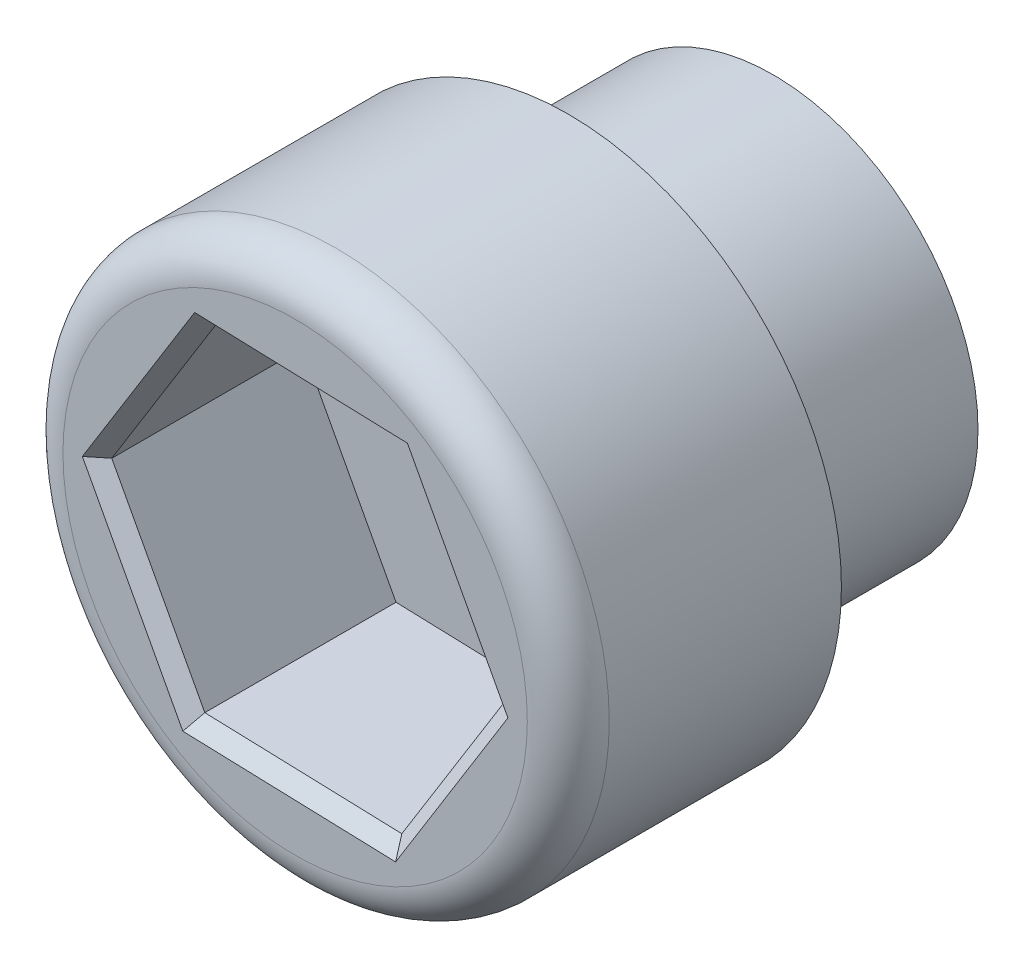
from build123d import *

# Parameters (mm, degrees)
SZKIC1_R                    = 3
DODANIE_WYCI_GNI_CIE1_DEPTH = 3
SZKIC2_R                    = 4
DODANIE_WYCI_GNI_CIE2_DEPTH = 4
WYTNIJ_WYCI_GNI_CIE1_DEPTH  = 3
ZAOKR_GLENIE1_R             = 0.6
SFAZOWANIE1_SIZE            = 0.2


with BuildPart() as part:
    # Szkic1 → Dodanie-wyci_gni_cie1 (new body)
    with BuildSketch(Plane.XY):
        Circle(SZKIC1_R)
    extrude(amount=DODANIE_WYCI_GNI_CIE1_DEPTH)

    # Szkic2 → Dodanie-wyci_gni_cie2 (add)
    with BuildSketch(Plane.XY.offset(3)):
        Circle(SZKIC2_R)
    extrude(amount=DODANIE_WYCI_GNI_CIE2_DEPTH)

    # Szkic3 → Wytnij-wyci_gni_cie1 (cut)
    with BuildSketch(Plane.XY.offset(7)):
        Polygon((-1.362395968, 2.545036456), (-2.885264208, 0.09264871), (-1.52286824, -2.452387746), (1.362395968, -2.545036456), (2.885264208, -0.09264871), (1.52286824, 2.452387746), align=None)
    extrude(amount=-WYTNIJ_WYCI_GNI_CIE1_DEPTH, mode=Mode.SUBTRACT)

    # Zaokr_glenie1
    zaokr_glenie1_edges = [part.edges().sort_by_distance(p)[0] for p in [
        (-4, 0, 7),
    ]]
    fillet(zaokr_glenie1_edges, radius=ZAOKR_GLENIE1_R)

    # Sfazowanie1
    sfazowanie1_edges = [part.edges().sort_by_distance(p)[0] for p in [
        (0.080236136, 2.498712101, 7),
        (-2.123830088, 1.318842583, 7),
        (-2.204066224, -1.179869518, 7),
        (-0.080236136, -2.498712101, 7),
        (2.123830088, -1.318842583, 7),
        (2.204066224, 1.179869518, 7),
    ]]
    chamfer(sfazowanie1_edges, length=SFAZOWANIE1_SIZE)


solid = part.part
